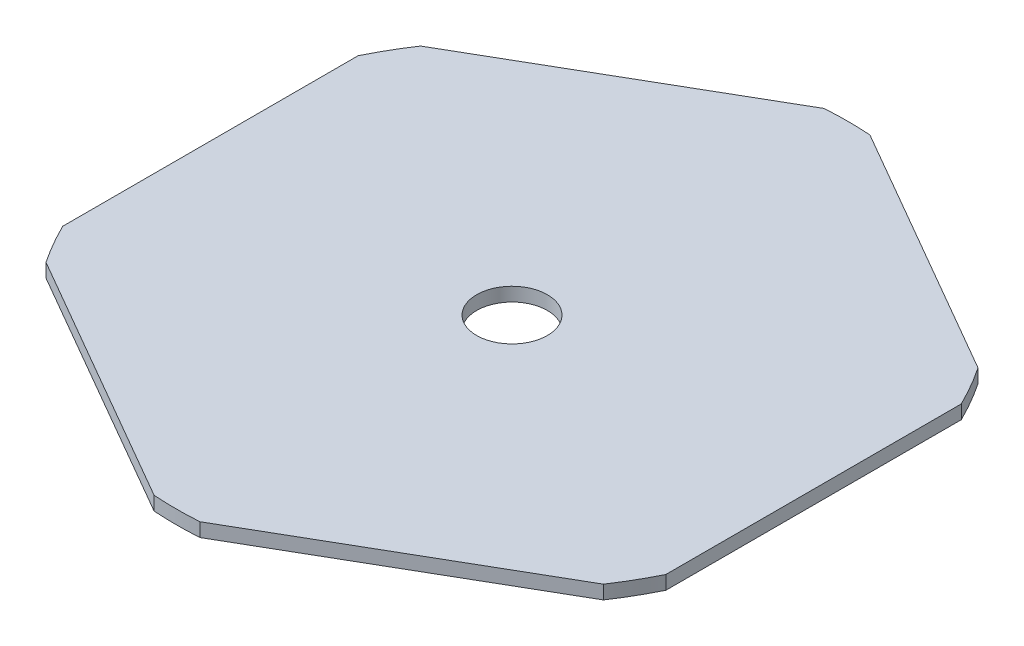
from build123d import *

# Parameters (mm, degrees)
SKETCH1_R          = 155.575
EXTRUDE1_DEPTH     = 6.35
SKETCH2_R          = 16.383
CUT_EXTRUDE1_DEPTH = 6.35
CUT_EXTRUDE2_DEPTH = 221.107891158
CIRPATTERN2_COUNT  = 6


with BuildPart() as part:
    # Sketch1 → Extrude1 (new body)
    with BuildSketch(Plane(origin=(0, 0, 0), x_dir=(1, 0, 0), z_dir=(0, 1, 0))):
        with Locations(Location((0, 0, 0), (0, 0, 270))):
            Circle(SKETCH1_R)
    extrude(amount=EXTRUDE1_DEPTH)

    # Sketch2 → Cut-Extrude1 (cut)
    with BuildSketch(Plane(origin=(0, 6.35, 0), x_dir=(-1, 0, 0), z_dir=(0, 1, 0))):
        with Locations(Location((0, 0, 0), (0, 0, 90))):
            Circle(SKETCH2_R)
    extrude(amount=-CUT_EXTRUDE1_DEPTH, mode=Mode.SUBTRACT)

    # Sketch4 → Cut-Extrude2 (cut, through all)
    with BuildSketch(Plane(origin=(0, 6.35, 0), x_dir=(-1, 0, 0), z_dir=(0, 1, 0))):
        with BuildLine():
            Line((31.040472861, 179.254741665), (-181.709731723, 56.423353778))
            ThreePointArc((-181.709731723, 56.423353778), (-99.239182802, 159.242948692), (31.040472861, 179.254741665))
        make_face()
    cut_extrude2 = extrude(amount=-CUT_EXTRUDE2_DEPTH, mode=Mode.SUBTRACT)

    # CirPattern2: Cut-Extrude2 ×6 about axis
    cirpattern2_axis = Axis((0, 0, 0), (0, 1, 0))
    for i in range(1, CIRPATTERN2_COUNT):
        add(cut_extrude2.rotate(cirpattern2_axis, i * 360 / CIRPATTERN2_COUNT), mode=Mode.SUBTRACT)


solid = part.part
